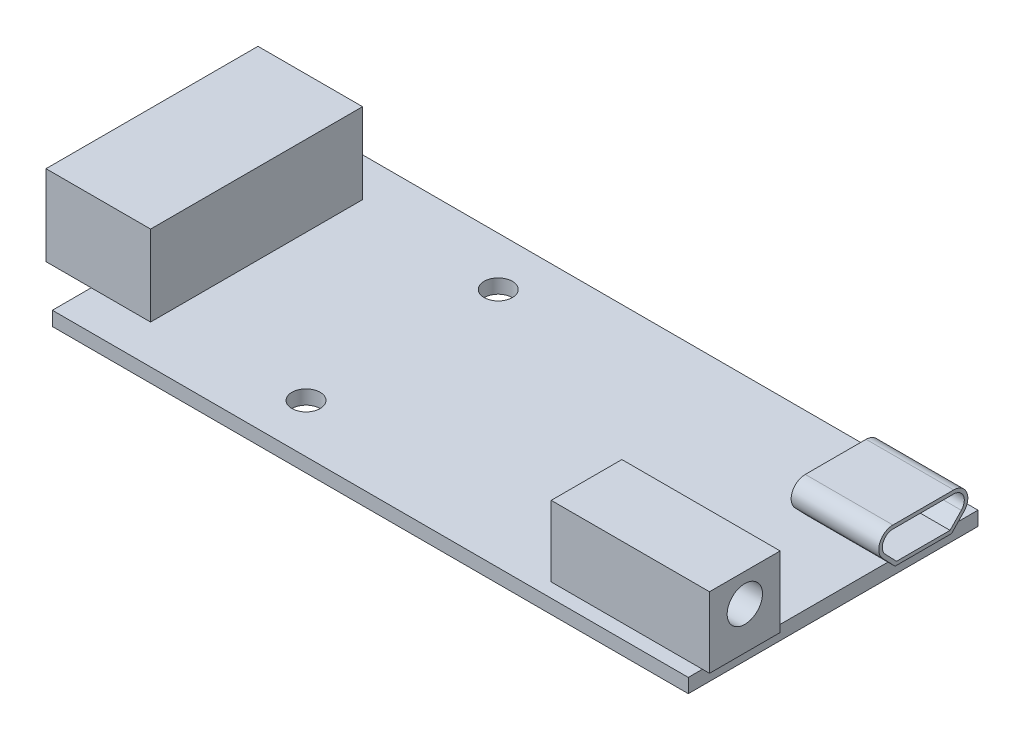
from build123d import *

# Parameters (mm, degrees)
SKETCH1_W                = 45
SKETCH1_H                = 20.5
SKETCH1_R                = 1
BOSS_EXTRUDE1_DEPTH      = 1
SKETCH2_W                = 7.4
SKETCH2_H                = 15
BOSS_EXTRUDE2_DEPTH      = 5.7
SKETCH3_W                = 13.6
SKETCH3_H                = 4.3
CUT_EXTRUDE1_DEPTH       = 6
SKETCH4_W                = 11.2
SKETCH4_H                = 5
BOSS_EXTRUDE3_DEPTH      = 5
SKETCH5_R                = 1.25
CUT_EXTRUDE2_DEPTH       = 8
BOSS_EXTRUDE4_DEPTH      = 0.5
BOSS_EXTRUDE4_DEPTH_BACK = 5.7


with BuildPart() as part:
    # Sketch1 → Boss-Extrude1 (new body)
    with BuildSketch(Plane(origin=(0, 0, 0), x_dir=(1, 0, 0), z_dir=(0, 1, 0))):
        Rectangle(SKETCH1_W, SKETCH1_H)
        with Locations(Location((-8, 6.8, 0), (0, 0, 270))):
            Circle(SKETCH1_R, mode=Mode.SUBTRACT)
        with Locations(Location((-8, -6.8, 0), (0, 0, 270))):
            Circle(SKETCH1_R, mode=Mode.SUBTRACT)
    extrude(amount=BOSS_EXTRUDE1_DEPTH)

    # Sketch2 → Boss-Extrude2 (add)
    with BuildSketch(Plane(origin=(0, 1, 0), x_dir=(1, 0, 0), z_dir=(0, 1, 0))):
        with Locations((-22, 0)):
            Rectangle(SKETCH2_W, SKETCH2_H)
    extrude(amount=BOSS_EXTRUDE2_DEPTH)

    # Sketch3 → Cut-Extrude1 (cut)
    with BuildSketch(Plane.ZY.offset(25.7)):
        with Locations((0, 3.85)):
            Rectangle(SKETCH3_W, SKETCH3_H)
    extrude(amount=-CUT_EXTRUDE1_DEPTH, mode=Mode.SUBTRACT)

    # Sketch4 → Boss-Extrude3 (add)
    with BuildSketch(Plane(origin=(0, 1, 0), x_dir=(1, 0, 0), z_dir=(0, 1, 0))):
        with Locations((17.4, -6.75)):
            Rectangle(SKETCH4_W, SKETCH4_H)
    extrude(amount=BOSS_EXTRUDE3_DEPTH)

    # Sketch5 → Cut-Extrude2 (cut)
    with BuildSketch(Plane(origin=(23, 0, 0), x_dir=(0, 0, -1), z_dir=(1, 0, 0))):
        with Locations((-6.75, 4)):
            Circle(SKETCH5_R)
    extrude(amount=-CUT_EXTRUDE2_DEPTH, mode=Mode.SUBTRACT)

    # Sketch6 → Boss-Extrude4 (add, two sides: drawn at the far end of the back side and taken through both)
    with BuildSketch(Plane(origin=(22.5, 0, 0), x_dir=(0, 0, -1), z_dir=(1, 0, 0)).offset(-BOSS_EXTRUDE4_DEPTH_BACK)):
        with BuildLine():
            Line((3.879166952, 1), (7.879166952, 1))
            Line((7.879166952, 1), (8.751177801, 1.906891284))
            ThreePointArc((8.751177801, 1.906891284), (8.950428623, 2.991721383), (8.030344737, 3.6))
            Line((8.030344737, 3.6), (3.727989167, 3.6))
            ThreePointArc((3.727989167, 3.6), (2.80790528, 2.991721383), (3.007156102, 1.906891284))
            Line((3.007156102, 1.906891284), (3.879166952, 1))
        make_face()
        with BuildLine():
            Line((3.985603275, 1.25), (7.772730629, 1.25))
            Line((7.772730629, 1.25), (8.570969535, 2.080168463))
            ThreePointArc((8.570969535, 2.080168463), (8.720407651, 2.893791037), (8.030344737, 3.35))
            Line((8.030344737, 3.35), (3.727989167, 3.35))
            ThreePointArc((3.727989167, 3.35), (3.037926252, 2.893791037), (3.187364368, 2.080168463))
            Line((3.187364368, 2.080168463), (3.985603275, 1.25))
        make_face(mode=Mode.SUBTRACT)
    extrude(amount=BOSS_EXTRUDE4_DEPTH + BOSS_EXTRUDE4_DEPTH_BACK)


solid = part.part
